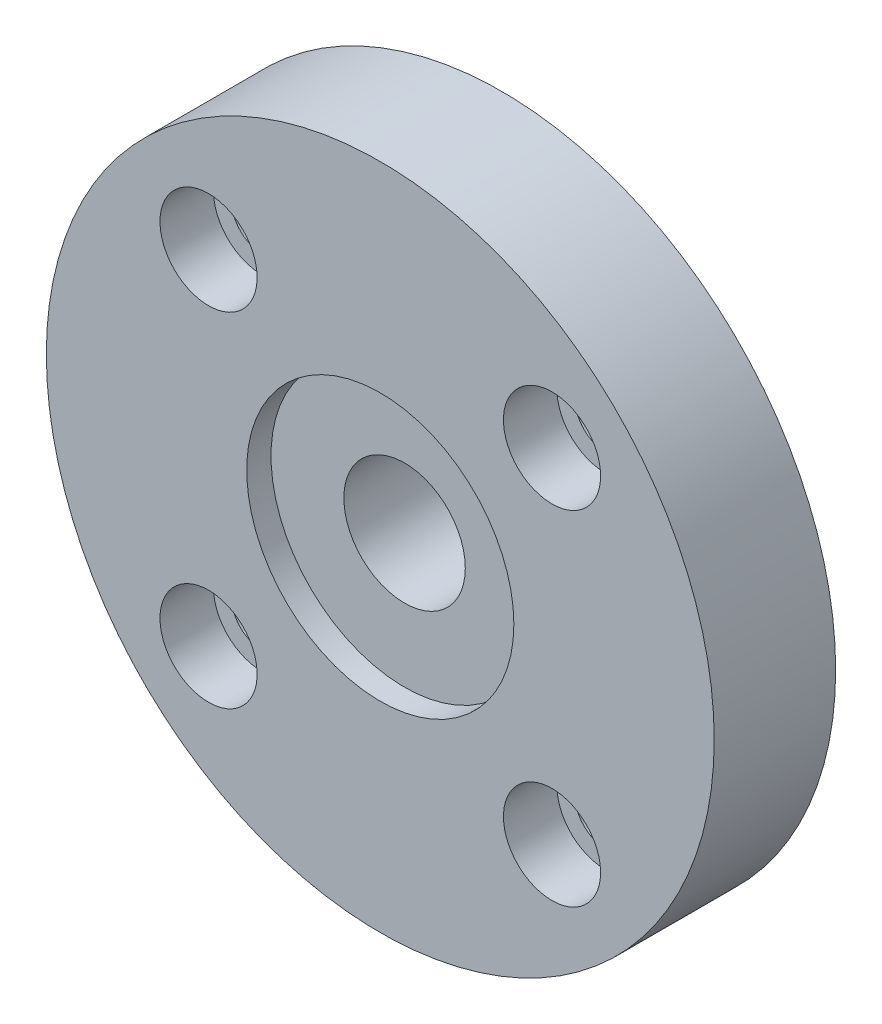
ISO-10303-21;
HEADER;
FILE_DESCRIPTION(('STEP AP214'),'2;1');
FILE_NAME('part.step','',(''),(''),'','','');
FILE_SCHEMA(('AUTOMOTIVE_DESIGN { 1 0 10303 214 1 1 1 1 }'));
ENDSEC;
DATA;
#1=APPLICATION_CONTEXT('core data for automotive mechanical design processes');
#2=APPLICATION_PROTOCOL_DEFINITION('international standard','automotive_design',2000,#1);
#3=PRODUCT_CONTEXT('',#1,'mechanical');
#4=PRODUCT('Part','Part','',(#3));
#5=PRODUCT_RELATED_PRODUCT_CATEGORY('part','',(#4));
#6=PRODUCT_DEFINITION_FORMATION('','',#4);
#7=PRODUCT_DEFINITION_CONTEXT('part definition',#1,'design');
#8=PRODUCT_DEFINITION('design','',#6,#7);
#9=PRODUCT_DEFINITION_SHAPE('','',#8);
#10=(LENGTH_UNIT() NAMED_UNIT(*) SI_UNIT(.MILLI.,.METRE.));
#11=(NAMED_UNIT(*) PLANE_ANGLE_UNIT() SI_UNIT($,.RADIAN.));
#12=(NAMED_UNIT(*) SI_UNIT($,.STERADIAN.) SOLID_ANGLE_UNIT());
#13=UNCERTAINTY_MEASURE_WITH_UNIT(LENGTH_MEASURE(1.E-05),#10,'distance_accuracy_value','');
#14=(GEOMETRIC_REPRESENTATION_CONTEXT(3) GLOBAL_UNCERTAINTY_ASSIGNED_CONTEXT((#13)) GLOBAL_UNIT_ASSIGNED_CONTEXT((#10,
#11,#12)) REPRESENTATION_CONTEXT('',''));
#15=CARTESIAN_POINT('',(0.,0.,0.));
#16=DIRECTION('',(0.,0.,1.));
#17=DIRECTION('',(1.,0.,0.));
#18=AXIS2_PLACEMENT_3D('',#15,#16,#17);
#19=CARTESIAN_POINT('',(0.,0.,10.));
#20=DIRECTION('',(0.,0.,-1.));
#21=DIRECTION('',(-1.,0.,0.));
#22=AXIS2_PLACEMENT_3D('',#19,#20,#21);
#23=CYLINDRICAL_SURFACE('',#22,5.);
#24=CARTESIAN_POINT('',(0.,0.,0.));
#25=DIRECTION('',(0.,0.,1.));
#26=DIRECTION('',(1.,0.,0.));
#27=AXIS2_PLACEMENT_3D('',#24,#25,#26);
#28=CIRCLE('',#27,5.);
#29=CARTESIAN_POINT('',(5.,0.,0.));
#30=VERTEX_POINT('',#29);
#31=EDGE_CURVE('E25',#30,#30,#28,.T.);
#32=ORIENTED_EDGE('',*,*,#31,.F.);
#33=EDGE_LOOP('',(#32));
#34=FACE_BOUND('',#33,.T.);
#35=CARTESIAN_POINT('',(0.,0.,8.));
#36=DIRECTION('',(0.,0.,1.));
#37=DIRECTION('',(1.,0.,0.));
#38=AXIS2_PLACEMENT_3D('',#35,#36,#37);
#39=CIRCLE('',#38,5.);
#40=CARTESIAN_POINT('',(5.,0.,8.));
#41=VERTEX_POINT('',#40);
#42=EDGE_CURVE('E16',#41,#41,#39,.T.);
#43=ORIENTED_EDGE('',*,*,#42,.T.);
#44=EDGE_LOOP('',(#43));
#45=FACE_BOUND('',#44,.T.);
#46=ADVANCED_FACE('F12',(#34,#45),#23,.F.);
#47=CARTESIAN_POINT('',(-14.1421356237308,14.1421356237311,0.));
#48=DIRECTION('',(0.,0.,1.));
#49=DIRECTION('',(1.,0.,0.));
#50=AXIS2_PLACEMENT_3D('',#47,#48,#49);
#51=CYLINDRICAL_SURFACE('',#50,2.5);
#52=CARTESIAN_POINT('',(-14.1421356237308,14.1421356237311,0.));
#53=DIRECTION('',(0.,0.,1.));
#54=DIRECTION('',(0.,1.,0.));
#55=AXIS2_PLACEMENT_3D('',#52,#53,#54);
#56=CIRCLE('',#55,2.5);
#57=CARTESIAN_POINT('',(-14.1421356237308,16.6421356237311,0.));
#58=VERTEX_POINT('',#57);
#59=EDGE_CURVE('E37',#58,#58,#56,.T.);
#60=ORIENTED_EDGE('',*,*,#59,.F.);
#61=EDGE_LOOP('',(#60));
#62=FACE_BOUND('',#61,.T.);
#63=CARTESIAN_POINT('',(-14.1421356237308,14.1421356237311,5.6));
#64=DIRECTION('',(0.,0.,1.));
#65=DIRECTION('',(1.,0.,0.));
#66=AXIS2_PLACEMENT_3D('',#63,#64,#65);
#67=CIRCLE('',#66,2.5);
#68=CARTESIAN_POINT('',(-11.6421356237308,14.1421356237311,5.6));
#69=VERTEX_POINT('',#68);
#70=EDGE_CURVE('E43',#69,#69,#67,.F.);
#71=ORIENTED_EDGE('',*,*,#70,.F.);
#72=EDGE_LOOP('',(#71));
#73=FACE_BOUND('',#72,.T.);
#74=ADVANCED_FACE('F87',(#62,#73),#51,.F.);
#75=CARTESIAN_POINT('',(-14.1421356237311,-14.1421356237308,0.));
#76=DIRECTION('',(0.,0.,1.));
#77=DIRECTION('',(1.,0.,0.));
#78=AXIS2_PLACEMENT_3D('',#75,#76,#77);
#79=CYLINDRICAL_SURFACE('',#78,2.5);
#80=CARTESIAN_POINT('',(-14.1421356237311,-14.1421356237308,0.));
#81=DIRECTION('',(0.,0.,1.));
#82=DIRECTION('',(-1.,0.,0.));
#83=AXIS2_PLACEMENT_3D('',#80,#81,#82);
#84=CIRCLE('',#83,2.5);
#85=CARTESIAN_POINT('',(-16.6421356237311,-14.1421356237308,0.));
#86=VERTEX_POINT('',#85);
#87=EDGE_CURVE('E68',#86,#86,#84,.T.);
#88=ORIENTED_EDGE('',*,*,#87,.F.);
#89=EDGE_LOOP('',(#88));
#90=FACE_BOUND('',#89,.T.);
#91=CARTESIAN_POINT('',(-14.1421356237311,-14.1421356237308,5.6));
#92=DIRECTION('',(0.,0.,1.));
#93=DIRECTION('',(1.,0.,0.));
#94=AXIS2_PLACEMENT_3D('',#91,#92,#93);
#95=CIRCLE('',#94,2.5);
#96=CARTESIAN_POINT('',(-11.6421356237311,-14.1421356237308,5.6));
#97=VERTEX_POINT('',#96);
#98=EDGE_CURVE('E39',#97,#97,#95,.F.);
#99=ORIENTED_EDGE('',*,*,#98,.F.);
#100=EDGE_LOOP('',(#99));
#101=FACE_BOUND('',#100,.T.);
#102=ADVANCED_FACE('F160',(#90,#101),#79,.F.);
#103=CARTESIAN_POINT('',(14.1421356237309,-14.142135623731,0.));
#104=DIRECTION('',(0.,0.,1.));
#105=DIRECTION('',(1.,0.,0.));
#106=AXIS2_PLACEMENT_3D('',#103,#104,#105);
#107=CYLINDRICAL_SURFACE('',#106,2.5);
#108=CARTESIAN_POINT('',(14.1421356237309,-14.142135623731,0.));
#109=DIRECTION('',(0.,0.,1.));
#110=DIRECTION('',(0.,-1.,0.));
#111=AXIS2_PLACEMENT_3D('',#108,#109,#110);
#112=CIRCLE('',#111,2.5);
#113=CARTESIAN_POINT('',(14.1421356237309,-16.642135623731,0.));
#114=VERTEX_POINT('',#113);
#115=EDGE_CURVE('E71',#114,#114,#112,.T.);
#116=ORIENTED_EDGE('',*,*,#115,.F.);
#117=EDGE_LOOP('',(#116));
#118=FACE_BOUND('',#117,.T.);
#119=CARTESIAN_POINT('',(14.1421356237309,-14.142135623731,5.6));
#120=DIRECTION('',(0.,0.,1.));
#121=DIRECTION('',(1.,0.,0.));
#122=AXIS2_PLACEMENT_3D('',#119,#120,#121);
#123=CIRCLE('',#122,2.5);
#124=CARTESIAN_POINT('',(16.6421356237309,-14.142135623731,5.6));
#125=VERTEX_POINT('',#124);
#126=EDGE_CURVE('E34',#125,#125,#123,.F.);
#127=ORIENTED_EDGE('',*,*,#126,.F.);
#128=EDGE_LOOP('',(#127));
#129=FACE_BOUND('',#128,.T.);
#130=ADVANCED_FACE('F135',(#118,#129),#107,.F.);
#131=CARTESIAN_POINT('',(14.142135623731,14.1421356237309,0.));
#132=DIRECTION('',(0.,0.,1.));
#133=DIRECTION('',(1.,0.,0.));
#134=AXIS2_PLACEMENT_3D('',#131,#132,#133);
#135=CYLINDRICAL_SURFACE('',#134,2.5);
#136=CARTESIAN_POINT('',(14.142135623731,14.1421356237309,0.));
#137=DIRECTION('',(0.,0.,1.));
#138=DIRECTION('',(1.,0.,0.));
#139=AXIS2_PLACEMENT_3D('',#136,#137,#138);
#140=CIRCLE('',#139,2.5);
#141=CARTESIAN_POINT('',(16.642135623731,14.1421356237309,0.));
#142=VERTEX_POINT('',#141);
#143=EDGE_CURVE('E32',#142,#142,#140,.T.);
#144=ORIENTED_EDGE('',*,*,#143,.F.);
#145=EDGE_LOOP('',(#144));
#146=FACE_BOUND('',#145,.T.);
#147=CARTESIAN_POINT('',(14.142135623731,14.1421356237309,5.6));
#148=DIRECTION('',(0.,0.,1.));
#149=DIRECTION('',(1.,0.,0.));
#150=AXIS2_PLACEMENT_3D('',#147,#148,#149);
#151=CIRCLE('',#150,2.5);
#152=CARTESIAN_POINT('',(16.642135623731,14.1421356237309,5.6));
#153=VERTEX_POINT('',#152);
#154=EDGE_CURVE('E29',#153,#153,#151,.F.);
#155=ORIENTED_EDGE('',*,*,#154,.F.);
#156=EDGE_LOOP('',(#155));
#157=FACE_BOUND('',#156,.T.);
#158=ADVANCED_FACE('F106',(#146,#157),#135,.F.);
#159=CARTESIAN_POINT('',(0.,0.,10.));
#160=DIRECTION('',(0.,0.,1.));
#161=DIRECTION('',(1.,0.,0.));
#162=AXIS2_PLACEMENT_3D('',#159,#160,#161);
#163=PLANE('',#162);
#164=CARTESIAN_POINT('',(0.,0.,10.));
#165=DIRECTION('',(0.,0.,1.));
#166=DIRECTION('',(1.,0.,0.));
#167=AXIS2_PLACEMENT_3D('',#164,#165,#166);
#168=CIRCLE('',#167,11.);
#169=CARTESIAN_POINT('',(11.,0.,10.));
#170=VERTEX_POINT('',#169);
#171=EDGE_CURVE('E94',#170,#170,#168,.T.);
#172=ORIENTED_EDGE('',*,*,#171,.F.);
#173=EDGE_LOOP('',(#172));
#174=FACE_BOUND('',#173,.T.);
#175=CARTESIAN_POINT('',(-14.1421356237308,14.1421356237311,10.));
#176=DIRECTION('',(0.,0.,1.));
#177=DIRECTION('',(0.,1.,0.));
#178=AXIS2_PLACEMENT_3D('',#175,#176,#177);
#179=CIRCLE('',#178,4.);
#180=CARTESIAN_POINT('',(-14.1421356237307,18.1421356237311,10.));
#181=VERTEX_POINT('',#180);
#182=EDGE_CURVE('E52',#181,#181,#179,.T.);
#183=ORIENTED_EDGE('',*,*,#182,.F.);
#184=EDGE_LOOP('',(#183));
#185=FACE_BOUND('',#184,.T.);
#186=CARTESIAN_POINT('',(-14.1421356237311,-14.1421356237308,10.));
#187=DIRECTION('',(0.,0.,1.));
#188=DIRECTION('',(-1.,0.,0.));
#189=AXIS2_PLACEMENT_3D('',#186,#187,#188);
#190=CIRCLE('',#189,4.);
#191=CARTESIAN_POINT('',(-18.1421356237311,-14.1421356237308,10.));
#192=VERTEX_POINT('',#191);
#193=EDGE_CURVE('E45',#192,#192,#190,.T.);
#194=ORIENTED_EDGE('',*,*,#193,.F.);
#195=EDGE_LOOP('',(#194));
#196=FACE_BOUND('',#195,.T.);
#197=CARTESIAN_POINT('',(14.1421356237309,-14.142135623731,10.));
#198=DIRECTION('',(0.,0.,1.));
#199=DIRECTION('',(0.,-1.,0.));
#200=AXIS2_PLACEMENT_3D('',#197,#198,#199);
#201=CIRCLE('',#200,4.);
#202=CARTESIAN_POINT('',(14.1421356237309,-18.142135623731,10.));
#203=VERTEX_POINT('',#202);
#204=EDGE_CURVE('E41',#203,#203,#201,.T.);
#205=ORIENTED_EDGE('',*,*,#204,.F.);
#206=EDGE_LOOP('',(#205));
#207=FACE_BOUND('',#206,.T.);
#208=CARTESIAN_POINT('',(14.142135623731,14.1421356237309,10.));
#209=DIRECTION('',(0.,0.,1.));
#210=DIRECTION('',(1.,0.,0.));
#211=AXIS2_PLACEMENT_3D('',#208,#209,#210);
#212=CIRCLE('',#211,4.);
#213=CARTESIAN_POINT('',(18.142135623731,14.1421356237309,10.));
#214=VERTEX_POINT('',#213);
#215=EDGE_CURVE('E74',#214,#214,#212,.T.);
#216=ORIENTED_EDGE('',*,*,#215,.F.);
#217=EDGE_LOOP('',(#216));
#218=FACE_BOUND('',#217,.T.);
#219=CARTESIAN_POINT('',(0.,0.,10.));
#220=DIRECTION('',(0.,0.,1.));
#221=DIRECTION('',(1.,0.,0.));
#222=AXIS2_PLACEMENT_3D('',#219,#220,#221);
#223=CIRCLE('',#222,27.5);
#224=CARTESIAN_POINT('',(27.5,0.,10.));
#225=VERTEX_POINT('',#224);
#226=EDGE_CURVE('E8',#225,#225,#223,.T.);
#227=ORIENTED_EDGE('',*,*,#226,.T.);
#228=EDGE_LOOP('',(#227));
#229=FACE_BOUND('',#228,.T.);
#230=ADVANCED_FACE('F103',(#174,#185,#196,#207,#218,#229),#163,.T.);
#231=CARTESIAN_POINT('',(0.,0.,0.));
#232=DIRECTION('',(0.,0.,1.));
#233=DIRECTION('',(1.,0.,0.));
#234=AXIS2_PLACEMENT_3D('',#231,#232,#233);
#235=PLANE('',#234);
#236=ORIENTED_EDGE('',*,*,#59,.T.);
#237=EDGE_LOOP('',(#236));
#238=FACE_BOUND('',#237,.T.);
#239=ORIENTED_EDGE('',*,*,#87,.T.);
#240=EDGE_LOOP('',(#239));
#241=FACE_BOUND('',#240,.T.);
#242=ORIENTED_EDGE('',*,*,#115,.T.);
#243=EDGE_LOOP('',(#242));
#244=FACE_BOUND('',#243,.T.);
#245=ORIENTED_EDGE('',*,*,#143,.T.);
#246=EDGE_LOOP('',(#245));
#247=FACE_BOUND('',#246,.T.);
#248=CARTESIAN_POINT('',(0.,0.,0.));
#249=DIRECTION('',(0.,0.,1.));
#250=DIRECTION('',(1.,0.,0.));
#251=AXIS2_PLACEMENT_3D('',#248,#249,#250);
#252=CIRCLE('',#251,27.5);
#253=CARTESIAN_POINT('',(27.5,0.,0.));
#254=VERTEX_POINT('',#253);
#255=EDGE_CURVE('E20',#254,#254,#252,.T.);
#256=ORIENTED_EDGE('',*,*,#255,.F.);
#257=EDGE_LOOP('',(#256));
#258=FACE_BOUND('',#257,.T.);
#259=ORIENTED_EDGE('',*,*,#31,.T.);
#260=EDGE_LOOP('',(#259));
#261=FACE_BOUND('',#260,.T.);
#262=ADVANCED_FACE('F83',(#238,#241,#244,#247,#258,#261),#235,.F.);
#263=CARTESIAN_POINT('',(0.,0.,10.));
#264=DIRECTION('',(0.,0.,-1.));
#265=DIRECTION('',(-1.,0.,0.));
#266=AXIS2_PLACEMENT_3D('',#263,#264,#265);
#267=CYLINDRICAL_SURFACE('',#266,27.5);
#268=ORIENTED_EDGE('',*,*,#226,.F.);
#269=EDGE_LOOP('',(#268));
#270=FACE_BOUND('',#269,.T.);
#271=ORIENTED_EDGE('',*,*,#255,.T.);
#272=EDGE_LOOP('',(#271));
#273=FACE_BOUND('',#272,.T.);
#274=ADVANCED_FACE('F14',(#270,#273),#267,.T.);
#275=CARTESIAN_POINT('',(14.142135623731,14.1421356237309,5.6));
#276=DIRECTION('',(0.,0.,1.));
#277=DIRECTION('',(1.,0.,0.));
#278=AXIS2_PLACEMENT_3D('',#275,#276,#277);
#279=PLANE('',#278);
#280=CARTESIAN_POINT('',(14.142135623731,14.1421356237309,5.6));
#281=DIRECTION('',(0.,0.,1.));
#282=DIRECTION('',(1.,0.,0.));
#283=AXIS2_PLACEMENT_3D('',#280,#281,#282);
#284=CIRCLE('',#283,4.);
#285=CARTESIAN_POINT('',(18.142135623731,14.1421356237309,5.6));
#286=VERTEX_POINT('',#285);
#287=EDGE_CURVE('E33',#286,#286,#284,.T.);
#288=ORIENTED_EDGE('',*,*,#287,.T.);
#289=EDGE_LOOP('',(#288));
#290=FACE_BOUND('',#289,.T.);
#291=ORIENTED_EDGE('',*,*,#154,.T.);
#292=EDGE_LOOP('',(#291));
#293=FACE_BOUND('',#292,.T.);
#294=ADVANCED_FACE('F118',(#290,#293),#279,.T.);
#295=CARTESIAN_POINT('',(14.142135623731,14.1421356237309,5.6));
#296=DIRECTION('',(0.,0.,1.));
#297=DIRECTION('',(1.,0.,0.));
#298=AXIS2_PLACEMENT_3D('',#295,#296,#297);
#299=CYLINDRICAL_SURFACE('',#298,4.);
#300=ORIENTED_EDGE('',*,*,#287,.F.);
#301=EDGE_LOOP('',(#300));
#302=FACE_BOUND('',#301,.T.);
#303=ORIENTED_EDGE('',*,*,#215,.T.);
#304=EDGE_LOOP('',(#303));
#305=FACE_BOUND('',#304,.T.);
#306=ADVANCED_FACE('F115',(#302,#305),#299,.F.);
#307=CARTESIAN_POINT('',(14.1421356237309,-14.142135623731,5.6));
#308=DIRECTION('',(0.,0.,1.));
#309=DIRECTION('',(1.,0.,0.));
#310=AXIS2_PLACEMENT_3D('',#307,#308,#309);
#311=PLANE('',#310);
#312=CARTESIAN_POINT('',(14.1421356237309,-14.142135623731,5.6));
#313=DIRECTION('',(0.,0.,1.));
#314=DIRECTION('',(0.,-1.,0.));
#315=AXIS2_PLACEMENT_3D('',#312,#313,#314);
#316=CIRCLE('',#315,4.);
#317=CARTESIAN_POINT('',(14.1421356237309,-18.142135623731,5.6));
#318=VERTEX_POINT('',#317);
#319=EDGE_CURVE('E38',#318,#318,#316,.T.);
#320=ORIENTED_EDGE('',*,*,#319,.T.);
#321=EDGE_LOOP('',(#320));
#322=FACE_BOUND('',#321,.T.);
#323=ORIENTED_EDGE('',*,*,#126,.T.);
#324=EDGE_LOOP('',(#323));
#325=FACE_BOUND('',#324,.T.);
#326=ADVANCED_FACE('F117',(#322,#325),#311,.T.);
#327=CARTESIAN_POINT('',(14.1421356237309,-14.142135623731,5.6));
#328=DIRECTION('',(0.,0.,1.));
#329=DIRECTION('',(1.,0.,0.));
#330=AXIS2_PLACEMENT_3D('',#327,#328,#329);
#331=CYLINDRICAL_SURFACE('',#330,4.);
#332=ORIENTED_EDGE('',*,*,#319,.F.);
#333=EDGE_LOOP('',(#332));
#334=FACE_BOUND('',#333,.T.);
#335=ORIENTED_EDGE('',*,*,#204,.T.);
#336=EDGE_LOOP('',(#335));
#337=FACE_BOUND('',#336,.T.);
#338=ADVANCED_FACE('F126',(#334,#337),#331,.F.);
#339=CARTESIAN_POINT('',(-14.1421356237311,-14.1421356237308,5.6));
#340=DIRECTION('',(0.,0.,1.));
#341=DIRECTION('',(1.,0.,0.));
#342=AXIS2_PLACEMENT_3D('',#339,#340,#341);
#343=PLANE('',#342);
#344=CARTESIAN_POINT('',(-14.1421356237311,-14.1421356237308,5.6));
#345=DIRECTION('',(0.,0.,1.));
#346=DIRECTION('',(-1.,0.,0.));
#347=AXIS2_PLACEMENT_3D('',#344,#345,#346);
#348=CIRCLE('',#347,4.);
#349=CARTESIAN_POINT('',(-18.1421356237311,-14.1421356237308,5.6));
#350=VERTEX_POINT('',#349);
#351=EDGE_CURVE('E42',#350,#350,#348,.T.);
#352=ORIENTED_EDGE('',*,*,#351,.T.);
#353=EDGE_LOOP('',(#352));
#354=FACE_BOUND('',#353,.T.);
#355=ORIENTED_EDGE('',*,*,#98,.T.);
#356=EDGE_LOOP('',(#355));
#357=FACE_BOUND('',#356,.T.);
#358=ADVANCED_FACE('F173',(#354,#357),#343,.T.);
#359=CARTESIAN_POINT('',(-14.1421356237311,-14.1421356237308,5.6));
#360=DIRECTION('',(0.,0.,1.));
#361=DIRECTION('',(1.,0.,0.));
#362=AXIS2_PLACEMENT_3D('',#359,#360,#361);
#363=CYLINDRICAL_SURFACE('',#362,4.);
#364=ORIENTED_EDGE('',*,*,#351,.F.);
#365=EDGE_LOOP('',(#364));
#366=FACE_BOUND('',#365,.T.);
#367=ORIENTED_EDGE('',*,*,#193,.T.);
#368=EDGE_LOOP('',(#367));
#369=FACE_BOUND('',#368,.T.);
#370=ADVANCED_FACE('F176',(#366,#369),#363,.F.);
#371=CARTESIAN_POINT('',(-14.1421356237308,14.1421356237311,5.6));
#372=DIRECTION('',(0.,0.,1.));
#373=DIRECTION('',(1.,0.,0.));
#374=AXIS2_PLACEMENT_3D('',#371,#372,#373);
#375=PLANE('',#374);
#376=CARTESIAN_POINT('',(-14.1421356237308,14.1421356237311,5.6));
#377=DIRECTION('',(0.,0.,1.));
#378=DIRECTION('',(0.,1.,0.));
#379=AXIS2_PLACEMENT_3D('',#376,#377,#378);
#380=CIRCLE('',#379,4.);
#381=CARTESIAN_POINT('',(-14.1421356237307,18.1421356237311,5.6));
#382=VERTEX_POINT('',#381);
#383=EDGE_CURVE('E46',#382,#382,#380,.T.);
#384=ORIENTED_EDGE('',*,*,#383,.T.);
#385=EDGE_LOOP('',(#384));
#386=FACE_BOUND('',#385,.T.);
#387=ORIENTED_EDGE('',*,*,#70,.T.);
#388=EDGE_LOOP('',(#387));
#389=FACE_BOUND('',#388,.T.);
#390=ADVANCED_FACE('F179',(#386,#389),#375,.T.);
#391=CARTESIAN_POINT('',(-14.1421356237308,14.1421356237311,5.6));
#392=DIRECTION('',(0.,0.,1.));
#393=DIRECTION('',(1.,0.,0.));
#394=AXIS2_PLACEMENT_3D('',#391,#392,#393);
#395=CYLINDRICAL_SURFACE('',#394,4.);
#396=ORIENTED_EDGE('',*,*,#383,.F.);
#397=EDGE_LOOP('',(#396));
#398=FACE_BOUND('',#397,.T.);
#399=ORIENTED_EDGE('',*,*,#182,.T.);
#400=EDGE_LOOP('',(#399));
#401=FACE_BOUND('',#400,.T.);
#402=ADVANCED_FACE('F184',(#398,#401),#395,.F.);
#403=CARTESIAN_POINT('',(0.,0.,8.));
#404=DIRECTION('',(0.,0.,1.));
#405=DIRECTION('',(1.,0.,0.));
#406=AXIS2_PLACEMENT_3D('',#403,#404,#405);
#407=CYLINDRICAL_SURFACE('',#406,11.);
#408=CARTESIAN_POINT('',(0.,0.,8.));
#409=DIRECTION('',(0.,0.,1.));
#410=DIRECTION('',(1.,0.,0.));
#411=AXIS2_PLACEMENT_3D('',#408,#409,#410);
#412=CIRCLE('',#411,11.);
#413=CARTESIAN_POINT('',(11.,0.,8.));
#414=VERTEX_POINT('',#413);
#415=EDGE_CURVE('E92',#414,#414,#412,.T.);
#416=ORIENTED_EDGE('',*,*,#415,.F.);
#417=EDGE_LOOP('',(#416));
#418=FACE_BOUND('',#417,.T.);
#419=ORIENTED_EDGE('',*,*,#171,.T.);
#420=EDGE_LOOP('',(#419));
#421=FACE_BOUND('',#420,.T.);
#422=ADVANCED_FACE('F101',(#418,#421),#407,.F.);
#423=CARTESIAN_POINT('',(0.,0.,8.));
#424=DIRECTION('',(0.,0.,1.));
#425=DIRECTION('',(1.,0.,0.));
#426=AXIS2_PLACEMENT_3D('',#423,#424,#425);
#427=PLANE('',#426);
#428=ORIENTED_EDGE('',*,*,#42,.F.);
#429=EDGE_LOOP('',(#428));
#430=FACE_BOUND('',#429,.T.);
#431=ORIENTED_EDGE('',*,*,#415,.T.);
#432=EDGE_LOOP('',(#431));
#433=FACE_BOUND('',#432,.T.);
#434=ADVANCED_FACE('F188',(#430,#433),#427,.T.);
#435=CLOSED_SHELL('',(#46,#74,#102,#130,#158,#230,#262,#274,#294,#306,#326,#338,#358,#370,#390,
#402,#422,#434));
#436=MANIFOLD_SOLID_BREP('B1',#435);
#437=ADVANCED_BREP_SHAPE_REPRESENTATION('',(#18,#436),#14);
#438=SHAPE_DEFINITION_REPRESENTATION(#9,#437);
ENDSEC;
END-ISO-10303-21;
